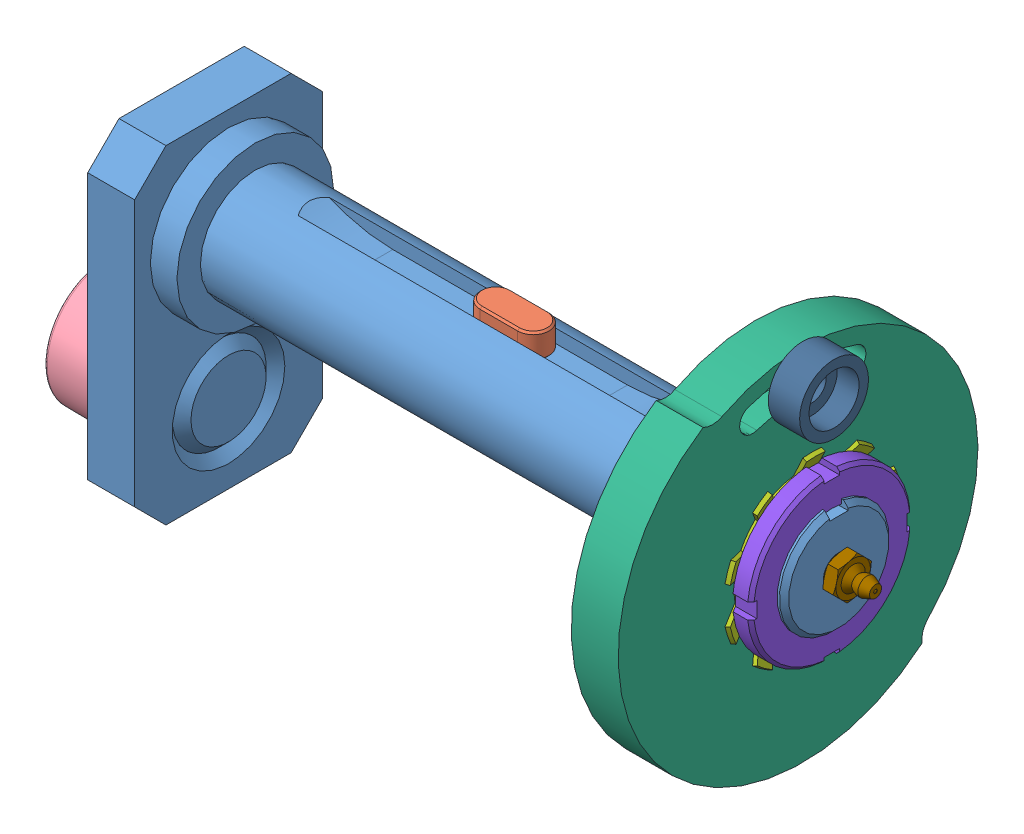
SolidWorks assembly manivelle.SLDASM, configuration Défaut (file format 5000). Lengths in mm.
Overall size (248.92 135.76 115).
10 component instances, 10 part files, 2 mates.
Components (placement in the parent):
- 063000538-1: 063000538.sldprt [Défaut] at origin size (237 105 60)
- 232001004(L22)-1: 232001004(L22).sldprt [Défaut] at (112.4059 12.5 -5) x (-1 0 0) z (0 1 0) size (22 10 8)
- 389067012-1: 389067012.sldprt [Défaut] at (173.5 0 0) x (0 -0.168939 -0.985627) z (1 0 0) size (50 50 10)
- 446000021-1: 446000021.sldprt [Défaut] at (-24.5 -50 0) x (1 0 0) z (0 0.636597 -0.771197) size (21 40 40)
- 230005010(C EX 17-230005010)-1: 230005010(C EX 17-230005010).sldprt [Défaut] at (-25.5 -50.3328 -0.0194) x (0 -0.05815 0.998308) z (1 0 0) size (18.63 19.37 1)
- 354000094-1: 354000094.sldprt [Défaut] at (183.5 0 0) x (0 -1 0) z (1 0 0) size (115 115 15) (hidden)
- 690046013-1: 690046013.sldprt [Défaut] at (198.5 0 0) x (-1 0 0) z (0 0 -1) size (4.21 57 55.75) (hidden)
- 375001018-1: 375001018.sldprt [Défaut] at (207.8 0 0) x (0 -1 0) z (0 0 1) size (51.76 8 51.76) (hidden)
- 455000079-1: 455000079.sldprt [Défaut] at (210.75 0 0) x (0 -0.96627 -0.25753) z (0 -0.25753 0.96627) size (11 16.17 12.7) (hidden)
- 582003227-1: 582003227.sldprt [Défaut] at (198.5 46.6 0) x (0 0 -1) z (0 -1 0) size (22 10 22) (hidden)
Mates (geometry in assembly coordinates):
- Coïncidente1: coincident anti-aligned: plane of 063000538-1 through (62.5 12.5 -5) normal (0 1 0); plane of 232001004(L22)-1 through (112.4059 12.5 0) normal (0 -1 0)
- Coïncidente3: coincident anti-aligned: plane of 063000538-1 through (137.5 62.5 -5) normal (0 0 1); plane of 232001004(L22)-1 through (112.4059 20.5 -5) normal (0 0 -1)
